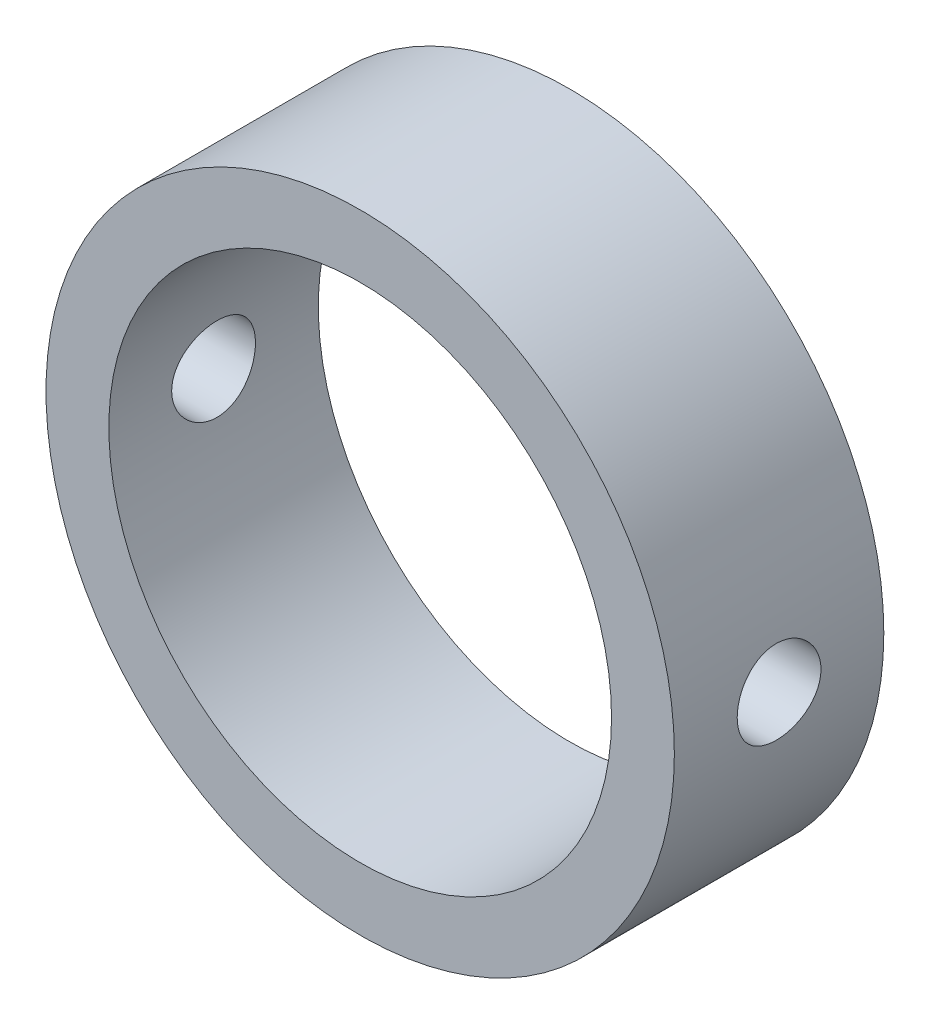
ISO-10303-21;
HEADER;
FILE_DESCRIPTION(('STEP AP214'),'2;1');
FILE_NAME('part.step','',(''),(''),'','','');
FILE_SCHEMA(('AUTOMOTIVE_DESIGN { 1 0 10303 214 1 1 1 1 }'));
ENDSEC;
DATA;
#1=APPLICATION_CONTEXT('core data for automotive mechanical design processes');
#2=APPLICATION_PROTOCOL_DEFINITION('international standard','automotive_design',2000,#1);
#3=PRODUCT_CONTEXT('',#1,'mechanical');
#4=PRODUCT('Part','Part','',(#3));
#5=PRODUCT_RELATED_PRODUCT_CATEGORY('part','',(#4));
#6=PRODUCT_DEFINITION_FORMATION('','',#4);
#7=PRODUCT_DEFINITION_CONTEXT('part definition',#1,'design');
#8=PRODUCT_DEFINITION('design','',#6,#7);
#9=PRODUCT_DEFINITION_SHAPE('','',#8);
#10=(LENGTH_UNIT() NAMED_UNIT(*) SI_UNIT(.MILLI.,.METRE.));
#11=(NAMED_UNIT(*) PLANE_ANGLE_UNIT() SI_UNIT($,.RADIAN.));
#12=(NAMED_UNIT(*) SI_UNIT($,.STERADIAN.) SOLID_ANGLE_UNIT());
#13=UNCERTAINTY_MEASURE_WITH_UNIT(LENGTH_MEASURE(1.E-05),#10,'distance_accuracy_value','');
#14=(GEOMETRIC_REPRESENTATION_CONTEXT(3) GLOBAL_UNCERTAINTY_ASSIGNED_CONTEXT((#13)) GLOBAL_UNIT_ASSIGNED_CONTEXT((#10,
#11,#12)) REPRESENTATION_CONTEXT('',''));
#15=CARTESIAN_POINT('',(0.,0.,0.));
#16=DIRECTION('',(0.,0.,1.));
#17=DIRECTION('',(1.,0.,0.));
#18=AXIS2_PLACEMENT_3D('',#15,#16,#17);
#19=CARTESIAN_POINT('',(0.,0.,20.));
#20=DIRECTION('',(0.,0.,1.));
#21=DIRECTION('',(1.,0.,0.));
#22=AXIS2_PLACEMENT_3D('',#19,#20,#21);
#23=PLANE('',#22);
#24=CARTESIAN_POINT('',(0.,0.,20.));
#25=DIRECTION('',(0.,0.,1.));
#26=DIRECTION('',(1.,0.,0.));
#27=AXIS2_PLACEMENT_3D('',#24,#25,#26);
#28=CIRCLE('',#27,30.);
#29=CARTESIAN_POINT('',(30.,0.,20.));
#30=VERTEX_POINT('',#29);
#31=EDGE_CURVE('E10',#30,#30,#28,.T.);
#32=ORIENTED_EDGE('',*,*,#31,.T.);
#33=EDGE_LOOP('',(#32));
#34=FACE_BOUND('',#33,.T.);
#35=CARTESIAN_POINT('',(0.,0.,20.));
#36=DIRECTION('',(0.,0.,1.));
#37=DIRECTION('',(1.,0.,0.));
#38=AXIS2_PLACEMENT_3D('',#35,#36,#37);
#39=CIRCLE('',#38,24.);
#40=CARTESIAN_POINT('',(24.,0.,20.));
#41=VERTEX_POINT('',#40);
#42=EDGE_CURVE('E47',#41,#41,#39,.T.);
#43=ORIENTED_EDGE('',*,*,#42,.F.);
#44=EDGE_LOOP('',(#43));
#45=FACE_BOUND('',#44,.T.);
#46=ADVANCED_FACE('F29',(#34,#45),#23,.T.);
#47=CARTESIAN_POINT('',(0.,0.,0.));
#48=DIRECTION('',(0.,0.,1.));
#49=DIRECTION('',(1.,0.,0.));
#50=AXIS2_PLACEMENT_3D('',#47,#48,#49);
#51=PLANE('',#50);
#52=CARTESIAN_POINT('',(0.,0.,0.));
#53=DIRECTION('',(0.,0.,1.));
#54=DIRECTION('',(1.,0.,0.));
#55=AXIS2_PLACEMENT_3D('',#52,#53,#54);
#56=CIRCLE('',#55,30.);
#57=CARTESIAN_POINT('',(30.,0.,0.));
#58=VERTEX_POINT('',#57);
#59=EDGE_CURVE('E42',#58,#58,#56,.T.);
#60=ORIENTED_EDGE('',*,*,#59,.F.);
#61=EDGE_LOOP('',(#60));
#62=FACE_BOUND('',#61,.T.);
#63=CARTESIAN_POINT('',(0.,0.,0.));
#64=DIRECTION('',(0.,0.,1.));
#65=DIRECTION('',(1.,0.,0.));
#66=AXIS2_PLACEMENT_3D('',#63,#64,#65);
#67=CIRCLE('',#66,24.);
#68=CARTESIAN_POINT('',(24.,0.,0.));
#69=VERTEX_POINT('',#68);
#70=EDGE_CURVE('E76',#69,#69,#67,.T.);
#71=ORIENTED_EDGE('',*,*,#70,.T.);
#72=EDGE_LOOP('',(#71));
#73=FACE_BOUND('',#72,.T.);
#74=ADVANCED_FACE('F84',(#62,#73),#51,.F.);
#75=CARTESIAN_POINT('',(0.,0.,20.));
#76=DIRECTION('',(0.,0.,-1.));
#77=DIRECTION('',(-1.,0.,0.));
#78=AXIS2_PLACEMENT_3D('',#75,#76,#77);
#79=CYLINDRICAL_SURFACE('',#78,30.);
#80=CARTESIAN_POINT('',(-30.,0.,14.));
#81=CARTESIAN_POINT('',(-29.9999967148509,-0.223617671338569,13.9999905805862));
#82=CARTESIAN_POINT('',(-29.9974734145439,-0.44737195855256,13.9811849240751));
#83=CARTESIAN_POINT('',(-29.9876502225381,-0.888645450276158,13.9064673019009));
#84=CARTESIAN_POINT('',(-29.9803454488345,-1.10615804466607,13.8505174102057));
#85=CARTESIAN_POINT('',(-29.9617815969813,-1.52849662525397,13.7031965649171));
#86=CARTESIAN_POINT('',(-29.9505252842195,-1.73333136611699,13.6118503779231));
#87=CARTESIAN_POINT('',(-29.9253077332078,-2.1247277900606,13.3963861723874));
#88=CARTESIAN_POINT('',(-29.9113469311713,-2.31129241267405,13.2722734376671));
#89=CARTESIAN_POINT('',(-29.8821798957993,-2.66205164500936,12.9939734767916));
#90=CARTESIAN_POINT('',(-29.8669671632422,-2.82611597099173,12.8396227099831));
#91=CARTESIAN_POINT('',(-29.837062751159,-3.12609471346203,12.5055796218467));
#92=CARTESIAN_POINT('',(-29.8223710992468,-3.26200763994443,12.3258859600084));
#93=CARTESIAN_POINT('',(-29.7951087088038,-3.50231804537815,11.9454017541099));
#94=CARTESIAN_POINT('',(-29.7825463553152,-3.60659214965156,11.7445326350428));
#95=CARTESIAN_POINT('',(-29.7610517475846,-3.7798769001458,11.3279378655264));
#96=CARTESIAN_POINT('',(-29.7521193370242,-3.84888906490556,11.1122128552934));
#97=CARTESIAN_POINT('',(-29.7389587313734,-3.94929213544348,10.6733883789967));
#98=CARTESIAN_POINT('',(-29.7347029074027,-3.98090408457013,10.4503403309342));
#99=CARTESIAN_POINT('',(-29.7312930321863,-4.00629361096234,10.0020676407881));
#100=CARTESIAN_POINT('',(-29.732138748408,-4.00007291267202,9.77684309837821));
#101=CARTESIAN_POINT('',(-29.7388111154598,-3.95015491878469,9.33215773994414));
#102=CARTESIAN_POINT('',(-29.7446052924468,-3.90670195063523,9.11266894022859));
#103=CARTESIAN_POINT('',(-29.7604710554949,-3.78393449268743,8.68412632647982));
#104=CARTESIAN_POINT('',(-29.7705427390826,-3.70461918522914,8.47507275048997));
#105=CARTESIAN_POINT('',(-29.7938652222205,-3.51211858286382,8.0725807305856));
#106=CARTESIAN_POINT('',(-29.807125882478,-3.39882795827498,7.87919325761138));
#107=CARTESIAN_POINT('',(-29.8353247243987,-3.14166786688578,7.51408183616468));
#108=CARTESIAN_POINT('',(-29.8502629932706,-2.9977968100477,7.34235901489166));
#109=CARTESIAN_POINT('',(-29.8802779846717,-2.68220980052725,7.02403397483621));
#110=CARTESIAN_POINT('',(-29.8953548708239,-2.51028341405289,6.87764031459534));
#111=CARTESIAN_POINT('',(-29.9238384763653,-2.14418834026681,6.61575591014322));
#112=CARTESIAN_POINT('',(-29.9372451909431,-1.95001958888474,6.50026525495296));
#113=CARTESIAN_POINT('',(-29.9608878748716,-1.54478443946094,6.30346176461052));
#114=CARTESIAN_POINT('',(-29.9711225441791,-1.33371115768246,6.22216293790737));
#115=CARTESIAN_POINT('',(-29.9872565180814,-0.900741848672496,6.09622136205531));
#116=CARTESIAN_POINT('',(-29.9931560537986,-0.678846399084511,6.05157665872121));
#117=CARTESIAN_POINT('',(-29.9999248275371,-0.232333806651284,6.00048313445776));
#118=CARTESIAN_POINT('',(-30.0008318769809,-0.00775006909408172,5.99374719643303));
#119=CARTESIAN_POINT('',(-29.9976158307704,0.439343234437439,6.01790332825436));
#120=CARTESIAN_POINT('',(-29.993492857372,0.661852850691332,6.04879448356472));
#121=CARTESIAN_POINT('',(-29.980703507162,1.09762743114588,6.14708930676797));
#122=CARTESIAN_POINT('',(-29.9720542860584,1.31092403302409,6.2143551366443));
#123=CARTESIAN_POINT('',(-29.9511801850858,1.72321019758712,6.38334593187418));
#124=CARTESIAN_POINT('',(-29.9389551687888,1.92219921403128,6.4850722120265));
#125=CARTESIAN_POINT('',(-29.9121967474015,2.30149775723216,6.72078431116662));
#126=CARTESIAN_POINT('',(-29.8976503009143,2.48169162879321,6.85495473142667));
#127=CARTESIAN_POINT('',(-29.8679145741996,2.8171058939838,7.15148665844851));
#128=CARTESIAN_POINT('',(-29.8527252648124,2.97232515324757,7.31384944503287));
#129=CARTESIAN_POINT('',(-29.8232980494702,3.25441098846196,7.6634262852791));
#130=CARTESIAN_POINT('',(-29.809066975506,3.38108655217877,7.85079513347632));
#131=CARTESIAN_POINT('',(-29.7832826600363,3.60116702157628,8.24431882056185));
#132=CARTESIAN_POINT('',(-29.7717293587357,3.69457267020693,8.45047323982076));
#133=CARTESIAN_POINT('',(-29.7526562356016,3.84515673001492,8.87511448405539));
#134=CARTESIAN_POINT('',(-29.745124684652,3.90244057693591,9.09356337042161));
#135=CARTESIAN_POINT('',(-29.7349149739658,3.97949334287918,9.53708726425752));
#136=CARTESIAN_POINT('',(-29.7322365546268,3.99926426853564,9.76216191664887));
#137=CARTESIAN_POINT('',(-29.732044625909,4.00068971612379,10.210646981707));
#138=CARTESIAN_POINT('',(-29.7344904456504,3.98264438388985,10.4340564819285));
#139=CARTESIAN_POINT('',(-29.744183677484,3.90958753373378,10.8746357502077));
#140=CARTESIAN_POINT('',(-29.7514310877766,3.85457602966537,11.091805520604));
#141=CARTESIAN_POINT('',(-29.7698978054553,3.70924620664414,11.5136873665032));
#142=CARTESIAN_POINT('',(-29.781115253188,3.61894441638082,11.7184052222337));
#143=CARTESIAN_POINT('',(-29.8062609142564,3.40562685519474,12.1098317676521));
#144=CARTESIAN_POINT('',(-29.8201891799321,3.28261045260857,12.2965401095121));
#145=CARTESIAN_POINT('',(-29.8493193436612,3.00624897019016,12.6481792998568));
#146=CARTESIAN_POINT('',(-29.8645301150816,2.85268054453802,12.8129338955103));
#147=CARTESIAN_POINT('',(-29.8944343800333,2.52004338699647,13.1144464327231));
#148=CARTESIAN_POINT('',(-29.9091277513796,2.34096868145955,13.2511977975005));
#149=CARTESIAN_POINT('',(-29.9364127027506,1.96150597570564,13.493334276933));
#150=CARTESIAN_POINT('',(-29.9489949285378,1.76102924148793,13.5985813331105));
#151=CARTESIAN_POINT('',(-29.9705464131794,1.34518481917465,13.7737611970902));
#152=CARTESIAN_POINT('',(-29.9795195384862,1.12983335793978,13.8437318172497));
#153=CARTESIAN_POINT('',(-29.9907144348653,0.761176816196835,13.9298960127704));
#154=CARTESIAN_POINT('',(-29.9941792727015,0.610182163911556,13.9561464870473));
#155=CARTESIAN_POINT('',(-29.9988231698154,0.306146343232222,13.9912016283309));
#156=CARTESIAN_POINT('',(-30.000002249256,0.15310519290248,14.0000064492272));
#157=CARTESIAN_POINT('',(-30.,0.,14.));
#158=B_SPLINE_CURVE_WITH_KNOTS('',3,(#80,#81,#82,#83,#84,#85,#86,#87,#88,#89,#90,#91,#92,#93,
#94,#95,#96,#97,#98,#99,#100,#101,#102,#103,#104,#105,#106,#107,#108,#109,#110,#111,#112,#113,
#114,#115,#116,#117,#118,#119,#120,#121,#122,#123,#124,#125,#126,#127,#128,#129,#130,#131,#132,
#133,#134,#135,#136,#137,#138,#139,#140,#141,#142,#143,#144,#145,#146,#147,#148,#149,#150,#151,
#152,#153,#154,#155,#156,#157),.UNSPECIFIED.,.T.,.F.,(4,2,2,2,2,2,2,2,2,2,2,2,2,2,2,2,2,2,2,2,2,
2,2,2,2,2,2,2,2,2,2,2,2,2,2,2,2,2,4),(0.,0.670293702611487,1.34127286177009,2.01178338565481,
2.68218585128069,3.35631956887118,4.03048895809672,4.70725443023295,5.38399075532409,
6.05670711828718,6.7293928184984,7.39769770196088,8.06601782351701,8.73643166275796,
9.40688036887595,10.082610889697,10.7583433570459,11.4343524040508,12.1103254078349,
12.7811716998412,13.4520016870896,14.1203072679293,14.7886383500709,15.4608654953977,
16.1331231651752,16.809754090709,17.486369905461,18.1610014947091,18.8355969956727,
19.5048585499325,20.1741198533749,20.8430680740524,21.5120292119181,22.1860733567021,
22.8602756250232,23.5373905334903,24.2137780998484,24.6727147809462,25.1316474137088),.UNSPECIFIED.);
#159=CARTESIAN_POINT('',(-30.,0.,14.));
#160=VERTEX_POINT('',#159);
#161=EDGE_CURVE('E71',#160,#160,#158,.T.);
#162=ORIENTED_EDGE('',*,*,#161,.T.);
#163=EDGE_LOOP('',(#162));
#164=FACE_BOUND('',#163,.T.);
#165=CARTESIAN_POINT('',(30.,0.,6.));
#166=CARTESIAN_POINT('',(29.9999967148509,-0.223617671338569,6.00000941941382));
#167=CARTESIAN_POINT('',(29.9974734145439,-0.44737195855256,6.01881507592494));
#168=CARTESIAN_POINT('',(29.9876502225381,-0.888645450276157,6.09353269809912));
#169=CARTESIAN_POINT('',(29.9803454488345,-1.10615804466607,6.1494825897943));
#170=CARTESIAN_POINT('',(29.9617815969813,-1.52849662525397,6.2968034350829));
#171=CARTESIAN_POINT('',(29.9505252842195,-1.73333136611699,6.38814962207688));
#172=CARTESIAN_POINT('',(29.9253077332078,-2.1247277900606,6.60361382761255));
#173=CARTESIAN_POINT('',(29.9113469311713,-2.31129241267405,6.72772656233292));
#174=CARTESIAN_POINT('',(29.8821798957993,-2.66205164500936,7.00602652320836));
#175=CARTESIAN_POINT('',(29.8669671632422,-2.82611597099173,7.16037729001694));
#176=CARTESIAN_POINT('',(29.837062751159,-3.12609471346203,7.49442037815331));
#177=CARTESIAN_POINT('',(29.8223710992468,-3.26200763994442,7.67411403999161));
#178=CARTESIAN_POINT('',(29.7951087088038,-3.50231804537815,8.05459824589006));
#179=CARTESIAN_POINT('',(29.7825463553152,-3.60659214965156,8.25546736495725));
#180=CARTESIAN_POINT('',(29.7610517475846,-3.7798769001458,8.67206213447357));
#181=CARTESIAN_POINT('',(29.7521193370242,-3.84888906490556,8.88778714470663));
#182=CARTESIAN_POINT('',(29.7389587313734,-3.94929213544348,9.32661162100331));
#183=CARTESIAN_POINT('',(29.7347029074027,-3.98090408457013,9.54965966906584));
#184=CARTESIAN_POINT('',(29.7312930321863,-4.00629361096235,9.99793235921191));
#185=CARTESIAN_POINT('',(29.732138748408,-4.00007291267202,10.2231569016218));
#186=CARTESIAN_POINT('',(29.7388111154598,-3.95015491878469,10.6678422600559));
#187=CARTESIAN_POINT('',(29.7446052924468,-3.90670195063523,10.8873310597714));
#188=CARTESIAN_POINT('',(29.7604710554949,-3.78393449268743,11.3158736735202));
#189=CARTESIAN_POINT('',(29.7705427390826,-3.70461918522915,11.52492724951));
#190=CARTESIAN_POINT('',(29.7938652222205,-3.51211858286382,11.9274192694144));
#191=CARTESIAN_POINT('',(29.807125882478,-3.39882795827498,12.1208067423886));
#192=CARTESIAN_POINT('',(29.8353247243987,-3.14166786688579,12.4859181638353));
#193=CARTESIAN_POINT('',(29.8502629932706,-2.9977968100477,12.6576409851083));
#194=CARTESIAN_POINT('',(29.8802779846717,-2.68220980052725,12.9759660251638));
#195=CARTESIAN_POINT('',(29.8953548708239,-2.51028341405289,13.1223596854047));
#196=CARTESIAN_POINT('',(29.9238384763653,-2.14418834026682,13.3842440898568));
#197=CARTESIAN_POINT('',(29.9372451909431,-1.95001958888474,13.499734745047));
#198=CARTESIAN_POINT('',(29.9608878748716,-1.54478443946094,13.6965382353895));
#199=CARTESIAN_POINT('',(29.9711225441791,-1.33371115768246,13.7778370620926));
#200=CARTESIAN_POINT('',(29.9872565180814,-0.900741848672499,13.9037786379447));
#201=CARTESIAN_POINT('',(29.9931560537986,-0.678846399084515,13.9484233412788));
#202=CARTESIAN_POINT('',(29.9999248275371,-0.232333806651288,13.9995168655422));
#203=CARTESIAN_POINT('',(30.0008318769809,-0.00775006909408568,14.006252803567));
#204=CARTESIAN_POINT('',(29.9976158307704,0.439343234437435,13.9820966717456));
#205=CARTESIAN_POINT('',(29.993492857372,0.661852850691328,13.9512055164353));
#206=CARTESIAN_POINT('',(29.980703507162,1.09762743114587,13.852910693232));
#207=CARTESIAN_POINT('',(29.9720542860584,1.31092403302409,13.7856448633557));
#208=CARTESIAN_POINT('',(29.9511801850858,1.72321019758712,13.6166540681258));
#209=CARTESIAN_POINT('',(29.9389551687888,1.92219921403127,13.5149277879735));
#210=CARTESIAN_POINT('',(29.9121967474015,2.30149775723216,13.2792156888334));
#211=CARTESIAN_POINT('',(29.8976503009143,2.48169162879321,13.1450452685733));
#212=CARTESIAN_POINT('',(29.8679145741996,2.81710589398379,12.8485133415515));
#213=CARTESIAN_POINT('',(29.8527252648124,2.97232515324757,12.6861505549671));
#214=CARTESIAN_POINT('',(29.8232980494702,3.25441098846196,12.3365737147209));
#215=CARTESIAN_POINT('',(29.809066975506,3.38108655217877,12.1492048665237));
#216=CARTESIAN_POINT('',(29.7832826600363,3.60116702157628,11.7556811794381));
#217=CARTESIAN_POINT('',(29.7717293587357,3.69457267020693,11.5495267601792));
#218=CARTESIAN_POINT('',(29.7526562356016,3.84515673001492,11.1248855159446));
#219=CARTESIAN_POINT('',(29.745124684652,3.90244057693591,10.9064366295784));
#220=CARTESIAN_POINT('',(29.7349149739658,3.97949334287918,10.4629127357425));
#221=CARTESIAN_POINT('',(29.7322365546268,3.99926426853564,10.2378380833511));
#222=CARTESIAN_POINT('',(29.732044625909,4.00068971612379,9.78935301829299));
#223=CARTESIAN_POINT('',(29.7344904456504,3.98264438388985,9.56594351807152));
#224=CARTESIAN_POINT('',(29.744183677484,3.90958753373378,9.12536424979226));
#225=CARTESIAN_POINT('',(29.7514310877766,3.85457602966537,8.90819447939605));
#226=CARTESIAN_POINT('',(29.7698978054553,3.70924620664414,8.48631263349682));
#227=CARTESIAN_POINT('',(29.781115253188,3.61894441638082,8.28159477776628));
#228=CARTESIAN_POINT('',(29.8062609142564,3.40562685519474,7.89016823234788));
#229=CARTESIAN_POINT('',(29.8201891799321,3.28261045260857,7.70345989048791));
#230=CARTESIAN_POINT('',(29.8493193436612,3.00624897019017,7.35182070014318));
#231=CARTESIAN_POINT('',(29.8645301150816,2.85268054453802,7.18706610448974));
#232=CARTESIAN_POINT('',(29.8944343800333,2.52004338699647,6.88555356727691));
#233=CARTESIAN_POINT('',(29.9091277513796,2.34096868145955,6.7488022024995));
#234=CARTESIAN_POINT('',(29.9364127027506,1.96150597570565,6.50666572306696));
#235=CARTESIAN_POINT('',(29.9489949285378,1.76102924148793,6.40141866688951));
#236=CARTESIAN_POINT('',(29.9705464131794,1.34518481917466,6.22623880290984));
#237=CARTESIAN_POINT('',(29.9795195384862,1.12983335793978,6.15626818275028));
#238=CARTESIAN_POINT('',(29.9907144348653,0.761176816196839,6.07010398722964));
#239=CARTESIAN_POINT('',(29.9941792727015,0.610182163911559,6.04385351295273));
#240=CARTESIAN_POINT('',(29.9988231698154,0.306146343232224,6.00879837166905));
#241=CARTESIAN_POINT('',(30.000002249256,0.153105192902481,5.99999355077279));
#242=CARTESIAN_POINT('',(30.,0.,6.));
#243=B_SPLINE_CURVE_WITH_KNOTS('',3,(#165,#166,#167,#168,#169,#170,#171,#172,#173,#174,#175,
#176,#177,#178,#179,#180,#181,#182,#183,#184,#185,#186,#187,#188,#189,#190,#191,#192,#193,#194,
#195,#196,#197,#198,#199,#200,#201,#202,#203,#204,#205,#206,#207,#208,#209,#210,#211,#212,#213,
#214,#215,#216,#217,#218,#219,#220,#221,#222,#223,#224,#225,#226,#227,#228,#229,#230,#231,#232,
#233,#234,#235,#236,#237,#238,#239,#240,#241,#242),.UNSPECIFIED.,.T.,.F.,(4,2,2,2,2,2,2,2,2,2,2,
2,2,2,2,2,2,2,2,2,2,2,2,2,2,2,2,2,2,2,2,2,2,2,2,2,2,2,4),(0.,0.670293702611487,1.34127286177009,
2.01178338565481,2.68218585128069,3.35631956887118,4.03048895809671,4.70725443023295,
5.38399075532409,6.05670711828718,6.7293928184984,7.39769770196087,8.06601782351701,
8.73643166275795,9.40688036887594,10.082610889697,10.7583433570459,11.4343524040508,
12.1103254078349,12.7811716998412,13.4520016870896,14.1203072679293,14.7886383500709,
15.4608654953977,16.1331231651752,16.809754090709,17.486369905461,18.1610014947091,
18.8355969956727,19.5048585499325,20.1741198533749,20.8430680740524,21.5120292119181,
22.1860733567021,22.8602756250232,23.5373905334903,24.2137780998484,24.6727147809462,
25.1316474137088),.UNSPECIFIED.);
#244=CARTESIAN_POINT('',(30.,0.,6.));
#245=VERTEX_POINT('',#244);
#246=EDGE_CURVE('E67',#245,#245,#243,.T.);
#247=ORIENTED_EDGE('',*,*,#246,.T.);
#248=EDGE_LOOP('',(#247));
#249=FACE_BOUND('',#248,.T.);
#250=ORIENTED_EDGE('',*,*,#31,.F.);
#251=EDGE_LOOP('',(#250));
#252=FACE_BOUND('',#251,.T.);
#253=ORIENTED_EDGE('',*,*,#59,.T.);
#254=EDGE_LOOP('',(#253));
#255=FACE_BOUND('',#254,.T.);
#256=ADVANCED_FACE('F31',(#164,#249,#252,#255),#79,.T.);
#257=CARTESIAN_POINT('',(0.,0.,20.));
#258=DIRECTION('',(0.,0.,-1.));
#259=DIRECTION('',(-1.,0.,0.));
#260=AXIS2_PLACEMENT_3D('',#257,#258,#259);
#261=CYLINDRICAL_SURFACE('',#260,24.);
#262=CARTESIAN_POINT('',(-24.,0.,14.));
#263=CARTESIAN_POINT('',(-23.9999961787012,-0.223025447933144,13.9999910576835));
#264=CARTESIAN_POINT('',(-23.9968588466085,-0.446172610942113,13.9812843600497));
#265=CARTESIAN_POINT('',(-23.9846455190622,-0.886208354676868,13.9069829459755));
#266=CARTESIAN_POINT('',(-23.9755640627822,-1.1030909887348,13.8513543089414));
#267=CARTESIAN_POINT('',(-23.9524810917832,-1.52416759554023,13.7049352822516));
#268=CARTESIAN_POINT('',(-23.9384836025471,-1.72837178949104,13.6141736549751));
#269=CARTESIAN_POINT('',(-23.9071076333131,-2.11862694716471,13.4001403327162));
#270=CARTESIAN_POINT('',(-23.8897295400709,-2.30467998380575,13.2768723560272));
#271=CARTESIAN_POINT('',(-23.853333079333,-2.65515618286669,13.0000718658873));
#272=CARTESIAN_POINT('',(-23.8343019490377,-2.81938064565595,12.8462894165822));
#273=CARTESIAN_POINT('',(-23.7968420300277,-3.11982159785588,12.5133632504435));
#274=CARTESIAN_POINT('',(-23.7784132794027,-3.25603631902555,12.3342179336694));
#275=CARTESIAN_POINT('',(-23.7441210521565,-3.49738740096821,11.9542864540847));
#276=CARTESIAN_POINT('',(-23.7282740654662,-3.6023272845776,11.7533738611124));
#277=CARTESIAN_POINT('',(-23.7011166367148,-3.77689338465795,11.336464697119));
#278=CARTESIAN_POINT('',(-23.6898058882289,-3.84652198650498,11.1204691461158));
#279=CARTESIAN_POINT('',(-23.6731285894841,-3.94786300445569,10.6816315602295));
#280=CARTESIAN_POINT('',(-23.6677082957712,-3.97991844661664,10.4588708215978));
#281=CARTESIAN_POINT('',(-23.6632630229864,-4.0062667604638,10.0110715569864));
#282=CARTESIAN_POINT('',(-23.6642375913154,-4.0005623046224,9.78603319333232));
#283=CARTESIAN_POINT('',(-23.6724228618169,-3.95183215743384,9.34251542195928));
#284=CARTESIAN_POINT('',(-23.6795691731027,-3.90919181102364,9.12399231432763));
#285=CARTESIAN_POINT('',(-23.6991919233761,-3.78840502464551,8.69724589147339));
#286=CARTESIAN_POINT('',(-23.7116685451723,-3.71025736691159,8.48902292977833));
#287=CARTESIAN_POINT('',(-23.7406156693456,-3.52028359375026,8.08763388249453));
#288=CARTESIAN_POINT('',(-23.7571050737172,-3.40829746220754,7.89454495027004));
#289=CARTESIAN_POINT('',(-23.7922066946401,-3.15393922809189,7.52975295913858));
#290=CARTESIAN_POINT('',(-23.8108190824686,-3.01156467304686,7.35805162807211));
#291=CARTESIAN_POINT('',(-23.8483524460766,-2.69837153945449,7.03867826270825));
#292=CARTESIAN_POINT('',(-23.8672743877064,-2.527222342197,6.89133037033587));
#293=CARTESIAN_POINT('',(-23.9030816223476,-2.16245639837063,6.62739557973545));
#294=CARTESIAN_POINT('',(-23.9199669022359,-1.96883950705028,6.51080887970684));
#295=CARTESIAN_POINT('',(-23.9498222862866,-1.56432946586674,6.31167643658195));
#296=CARTESIAN_POINT('',(-23.9627890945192,-1.35342196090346,6.22915932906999));
#297=CARTESIAN_POINT('',(-23.9833200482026,-0.92047735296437,6.10080925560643));
#298=CARTESIAN_POINT('',(-23.9908846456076,-0.698441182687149,6.05497322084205));
#299=CARTESIAN_POINT('',(-23.999698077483,-0.252335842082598,6.00172582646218));
#300=CARTESIAN_POINT('',(-24.0010200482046,-0.0283211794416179,5.99386948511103));
#301=CARTESIAN_POINT('',(-23.9973995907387,0.41782363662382,6.015618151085));
#302=CARTESIAN_POINT('',(-23.9924574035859,0.639953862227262,6.04522171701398));
#303=CARTESIAN_POINT('',(-23.9769092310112,1.07464988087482,6.14067975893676));
#304=CARTESIAN_POINT('',(-23.966337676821,1.28726538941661,6.2063139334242));
#305=CARTESIAN_POINT('',(-23.9407114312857,1.69847501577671,6.37173522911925));
#306=CARTESIAN_POINT('',(-23.9256564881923,1.89706834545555,6.47152426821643));
#307=CARTESIAN_POINT('',(-23.8925522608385,2.27652910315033,6.70344179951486));
#308=CARTESIAN_POINT('',(-23.8744776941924,2.45722440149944,6.8358482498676));
#309=CARTESIAN_POINT('',(-23.8374154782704,2.7939897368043,7.12885970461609));
#310=CARTESIAN_POINT('',(-23.8184277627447,2.95005798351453,7.28946675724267));
#311=CARTESIAN_POINT('',(-23.7814428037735,3.2347884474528,7.63631607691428));
#312=CARTESIAN_POINT('',(-23.7634578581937,3.36315001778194,7.82280666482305));
#313=CARTESIAN_POINT('',(-23.7307444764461,3.58672369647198,8.21496475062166));
#314=CARTESIAN_POINT('',(-23.7160159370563,3.68193685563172,8.42063164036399));
#315=CARTESIAN_POINT('',(-23.6915752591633,3.83606133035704,8.84446357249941));
#316=CARTESIAN_POINT('',(-23.681842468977,3.89512229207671,9.06257295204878));
#317=CARTESIAN_POINT('',(-23.6684434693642,3.97573672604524,9.50579220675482));
#318=CARTESIAN_POINT('',(-23.6647767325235,3.99729345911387,9.73090147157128));
#319=CARTESIAN_POINT('',(-23.6639477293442,4.00219658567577,10.1787282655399));
#320=CARTESIAN_POINT('',(-23.6667049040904,3.9860162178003,10.4014406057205));
#321=CARTESIAN_POINT('',(-23.6782365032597,3.91692774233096,10.8409267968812));
#322=CARTESIAN_POINT('',(-23.6870109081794,3.86401975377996,11.057700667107));
#323=CARTESIAN_POINT('',(-23.7095577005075,3.72315918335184,11.4789734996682));
#324=CARTESIAN_POINT('',(-23.7233242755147,3.63524734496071,11.6834864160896));
#325=CARTESIAN_POINT('',(-23.7543099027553,3.42692320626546,12.0749370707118));
#326=CARTESIAN_POINT('',(-23.7715291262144,3.3065092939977,12.2618739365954));
#327=CARTESIAN_POINT('',(-23.80773526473,3.03491021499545,12.6152569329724));
#328=CARTESIAN_POINT('',(-23.8267407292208,2.88337690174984,12.7814336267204));
#329=CARTESIAN_POINT('',(-23.8642299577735,2.55457445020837,13.0861625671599));
#330=CARTESIAN_POINT('',(-23.8827136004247,2.37729938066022,13.2247084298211));
#331=CARTESIAN_POINT('',(-23.9172244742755,2.00059067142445,13.4711172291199));
#332=CARTESIAN_POINT('',(-23.9332338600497,1.80101246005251,13.5787616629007));
#333=CARTESIAN_POINT('',(-23.9608186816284,1.38642091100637,13.7588311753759));
#334=CARTESIAN_POINT('',(-23.9723985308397,1.17142319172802,13.8312913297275));
#335=CARTESIAN_POINT('',(-23.9872926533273,0.796325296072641,13.9232084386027));
#336=CARTESIAN_POINT('',(-23.9920324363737,0.638494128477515,13.9519591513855));
#337=CARTESIAN_POINT('',(-23.9983874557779,0.320462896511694,13.9903579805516));
#338=CARTESIAN_POINT('',(-24.0000027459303,0.160262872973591,14.0000064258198));
#339=CARTESIAN_POINT('',(-24.,0.,14.));
#340=B_SPLINE_CURVE_WITH_KNOTS('',3,(#262,#263,#264,#265,#266,#267,#268,#269,#270,#271,#272,
#273,#274,#275,#276,#277,#278,#279,#280,#281,#282,#283,#284,#285,#286,#287,#288,#289,#290,#291,
#292,#293,#294,#295,#296,#297,#298,#299,#300,#301,#302,#303,#304,#305,#306,#307,#308,#309,#310,
#311,#312,#313,#314,#315,#316,#317,#318,#319,#320,#321,#322,#323,#324,#325,#326,#327,#328,#329,
#330,#331,#332,#333,#334,#335,#336,#337,#338,#339),.UNSPECIFIED.,.T.,.F.,(4,2,2,2,2,2,2,2,2,2,2,
2,2,2,2,2,2,2,2,2,2,2,2,2,2,2,2,2,2,2,2,2,2,2,2,2,2,2,4),(0.,0.668490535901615,1.33759607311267,
2.00615498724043,2.67463746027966,3.34883985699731,4.02308480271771,4.70148033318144,
5.3798300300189,6.05193723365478,6.72399686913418,7.38912834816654,8.0542826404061,
8.72263290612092,9.39103713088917,10.0677243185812,10.7444158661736,11.4216750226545,
12.0988775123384,12.7681261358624,13.4373490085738,14.1025249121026,14.7677381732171,
15.4388292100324,16.1099690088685,16.7880611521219,17.4661317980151,18.1413763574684,
18.8165622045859,19.4833265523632,20.1500887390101,20.8160770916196,21.4820984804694,
22.1560221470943,22.8301013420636,23.5088357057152,24.1868920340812,24.6672679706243,
25.1476356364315),.UNSPECIFIED.);
#341=CARTESIAN_POINT('',(-24.,0.,14.));
#342=VERTEX_POINT('',#341);
#343=EDGE_CURVE('E34',#342,#342,#340,.T.);
#344=ORIENTED_EDGE('',*,*,#343,.F.);
#345=EDGE_LOOP('',(#344));
#346=FACE_BOUND('',#345,.T.);
#347=CARTESIAN_POINT('',(24.,0.,6.));
#348=CARTESIAN_POINT('',(23.9999961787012,-0.223025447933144,6.00000894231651));
#349=CARTESIAN_POINT('',(23.9968588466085,-0.446172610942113,6.01871563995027));
#350=CARTESIAN_POINT('',(23.9846455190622,-0.886208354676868,6.09301705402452));
#351=CARTESIAN_POINT('',(23.9755640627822,-1.1030909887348,6.14864569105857));
#352=CARTESIAN_POINT('',(23.9524810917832,-1.52416759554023,6.29506471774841));
#353=CARTESIAN_POINT('',(23.9384836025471,-1.72837178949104,6.38582634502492));
#354=CARTESIAN_POINT('',(23.9071076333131,-2.11862694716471,6.59985966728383));
#355=CARTESIAN_POINT('',(23.8897295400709,-2.30467998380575,6.7231276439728));
#356=CARTESIAN_POINT('',(23.853333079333,-2.65515618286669,6.99992813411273));
#357=CARTESIAN_POINT('',(23.8343019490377,-2.81938064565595,7.15371058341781));
#358=CARTESIAN_POINT('',(23.7968420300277,-3.11982159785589,7.4866367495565));
#359=CARTESIAN_POINT('',(23.7784132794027,-3.25603631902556,7.66578206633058));
#360=CARTESIAN_POINT('',(23.7441210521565,-3.49738740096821,8.04571354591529));
#361=CARTESIAN_POINT('',(23.7282740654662,-3.6023272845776,8.24662613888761));
#362=CARTESIAN_POINT('',(23.7011166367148,-3.77689338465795,8.663535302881));
#363=CARTESIAN_POINT('',(23.6898058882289,-3.84652198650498,8.87953085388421));
#364=CARTESIAN_POINT('',(23.6731285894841,-3.94786300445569,9.31836843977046));
#365=CARTESIAN_POINT('',(23.6677082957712,-3.97991844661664,9.54112917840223));
#366=CARTESIAN_POINT('',(23.6632630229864,-4.0062667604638,9.98892844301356));
#367=CARTESIAN_POINT('',(23.6642375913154,-4.00056230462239,10.2139668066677));
#368=CARTESIAN_POINT('',(23.6724228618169,-3.95183215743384,10.6574845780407));
#369=CARTESIAN_POINT('',(23.6795691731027,-3.90919181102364,10.8760076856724));
#370=CARTESIAN_POINT('',(23.6991919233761,-3.78840502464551,11.3027541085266));
#371=CARTESIAN_POINT('',(23.7116685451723,-3.71025736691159,11.5109770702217));
#372=CARTESIAN_POINT('',(23.7406156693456,-3.52028359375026,11.9123661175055));
#373=CARTESIAN_POINT('',(23.7571050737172,-3.40829746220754,12.10545504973));
#374=CARTESIAN_POINT('',(23.7922066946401,-3.15393922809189,12.4702470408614));
#375=CARTESIAN_POINT('',(23.8108190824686,-3.01156467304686,12.6419483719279));
#376=CARTESIAN_POINT('',(23.8483524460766,-2.69837153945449,12.9613217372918));
#377=CARTESIAN_POINT('',(23.8672743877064,-2.527222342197,13.1086696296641));
#378=CARTESIAN_POINT('',(23.9030816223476,-2.16245639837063,13.3726044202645));
#379=CARTESIAN_POINT('',(23.9199669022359,-1.96883950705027,13.4891911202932));
#380=CARTESIAN_POINT('',(23.9498222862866,-1.56432946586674,13.6883235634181));
#381=CARTESIAN_POINT('',(23.9627890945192,-1.35342196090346,13.77084067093));
#382=CARTESIAN_POINT('',(23.9833200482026,-0.920477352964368,13.8991907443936));
#383=CARTESIAN_POINT('',(23.9908846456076,-0.698441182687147,13.9450267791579));
#384=CARTESIAN_POINT('',(23.999698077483,-0.252335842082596,13.9982741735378));
#385=CARTESIAN_POINT('',(24.0010200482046,-0.0283211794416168,14.006130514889));
#386=CARTESIAN_POINT('',(23.9973995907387,0.417823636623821,13.984381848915));
#387=CARTESIAN_POINT('',(23.9924574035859,0.639953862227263,13.954778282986));
#388=CARTESIAN_POINT('',(23.9769092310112,1.07464988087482,13.8593202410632));
#389=CARTESIAN_POINT('',(23.966337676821,1.28726538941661,13.7936860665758));
#390=CARTESIAN_POINT('',(23.9407114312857,1.69847501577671,13.6282647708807));
#391=CARTESIAN_POINT('',(23.9256564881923,1.89706834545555,13.5284757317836));
#392=CARTESIAN_POINT('',(23.8925522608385,2.27652910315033,13.2965582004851));
#393=CARTESIAN_POINT('',(23.8744776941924,2.45722440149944,13.1641517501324));
#394=CARTESIAN_POINT('',(23.8374154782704,2.7939897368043,12.8711402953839));
#395=CARTESIAN_POINT('',(23.8184277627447,2.95005798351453,12.7105332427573));
#396=CARTESIAN_POINT('',(23.7814428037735,3.2347884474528,12.3636839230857));
#397=CARTESIAN_POINT('',(23.7634578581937,3.36315001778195,12.1771933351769));
#398=CARTESIAN_POINT('',(23.7307444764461,3.58672369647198,11.7850352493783));
#399=CARTESIAN_POINT('',(23.7160159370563,3.68193685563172,11.579368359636));
#400=CARTESIAN_POINT('',(23.6915752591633,3.83606133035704,11.1555364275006));
#401=CARTESIAN_POINT('',(23.681842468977,3.89512229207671,10.9374270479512));
#402=CARTESIAN_POINT('',(23.6684434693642,3.97573672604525,10.4942077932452));
#403=CARTESIAN_POINT('',(23.6647767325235,3.99729345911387,10.2690985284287));
#404=CARTESIAN_POINT('',(23.6639477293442,4.00219658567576,9.82127173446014));
#405=CARTESIAN_POINT('',(23.6667049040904,3.9860162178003,9.59855939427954));
#406=CARTESIAN_POINT('',(23.6782365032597,3.91692774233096,9.15907320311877));
#407=CARTESIAN_POINT('',(23.6870109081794,3.86401975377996,8.942299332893));
#408=CARTESIAN_POINT('',(23.7095577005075,3.72315918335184,8.52102650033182));
#409=CARTESIAN_POINT('',(23.7233242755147,3.63524734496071,8.31651358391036));
#410=CARTESIAN_POINT('',(23.7543099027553,3.42692320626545,7.92506292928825));
#411=CARTESIAN_POINT('',(23.7715291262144,3.3065092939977,7.73812606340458));
#412=CARTESIAN_POINT('',(23.8077352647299,3.03491021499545,7.38474306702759));
#413=CARTESIAN_POINT('',(23.8267407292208,2.88337690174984,7.21856637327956));
#414=CARTESIAN_POINT('',(23.8642299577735,2.55457445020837,6.9138374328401));
#415=CARTESIAN_POINT('',(23.8827136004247,2.37729938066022,6.77529157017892));
#416=CARTESIAN_POINT('',(23.9172244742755,2.00059067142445,6.52888277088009));
#417=CARTESIAN_POINT('',(23.9332338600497,1.80101246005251,6.42123833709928));
#418=CARTESIAN_POINT('',(23.9608186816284,1.38642091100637,6.24116882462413));
#419=CARTESIAN_POINT('',(23.9723985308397,1.17142319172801,6.16870867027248));
#420=CARTESIAN_POINT('',(23.9872926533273,0.79632529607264,6.07679156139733));
#421=CARTESIAN_POINT('',(23.9920324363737,0.638494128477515,6.04804084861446));
#422=CARTESIAN_POINT('',(23.9983874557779,0.320462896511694,6.0096420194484));
#423=CARTESIAN_POINT('',(24.0000027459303,0.16026287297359,5.99999357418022));
#424=CARTESIAN_POINT('',(24.,0.,6.));
#425=B_SPLINE_CURVE_WITH_KNOTS('',3,(#347,#348,#349,#350,#351,#352,#353,#354,#355,#356,#357,
#358,#359,#360,#361,#362,#363,#364,#365,#366,#367,#368,#369,#370,#371,#372,#373,#374,#375,#376,
#377,#378,#379,#380,#381,#382,#383,#384,#385,#386,#387,#388,#389,#390,#391,#392,#393,#394,#395,
#396,#397,#398,#399,#400,#401,#402,#403,#404,#405,#406,#407,#408,#409,#410,#411,#412,#413,#414,
#415,#416,#417,#418,#419,#420,#421,#422,#423,#424),.UNSPECIFIED.,.T.,.F.,(4,2,2,2,2,2,2,2,2,2,2,
2,2,2,2,2,2,2,2,2,2,2,2,2,2,2,2,2,2,2,2,2,2,2,2,2,2,2,4),(0.,0.668490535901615,1.33759607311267,
2.00615498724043,2.67463746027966,3.34883985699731,4.02308480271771,4.70148033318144,
5.3798300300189,6.05193723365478,6.72399686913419,7.38912834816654,8.0542826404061,
8.72263290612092,9.39103713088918,10.0677243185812,10.7444158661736,11.4216750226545,
12.0988775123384,12.7681261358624,13.4373490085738,14.1025249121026,14.7677381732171,
15.4388292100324,16.1099690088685,16.7880611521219,17.4661317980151,18.1413763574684,
18.8165622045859,19.4833265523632,20.1500887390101,20.8160770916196,21.4820984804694,
22.1560221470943,22.8301013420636,23.5088357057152,24.1868920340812,24.6672679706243,
25.1476356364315),.UNSPECIFIED.);
#426=CARTESIAN_POINT('',(24.,0.,6.));
#427=VERTEX_POINT('',#426);
#428=EDGE_CURVE('E50',#427,#427,#425,.T.);
#429=ORIENTED_EDGE('',*,*,#428,.F.);
#430=EDGE_LOOP('',(#429));
#431=FACE_BOUND('',#430,.T.);
#432=ORIENTED_EDGE('',*,*,#42,.T.);
#433=EDGE_LOOP('',(#432));
#434=FACE_BOUND('',#433,.T.);
#435=ORIENTED_EDGE('',*,*,#70,.F.);
#436=EDGE_LOOP('',(#435));
#437=FACE_BOUND('',#436,.T.);
#438=ADVANCED_FACE('F54',(#346,#431,#434,#437),#261,.F.);
#439=CARTESIAN_POINT('',(-40.,0.,10.));
#440=DIRECTION('',(1.,0.,0.));
#441=DIRECTION('',(0.,0.,-1.));
#442=AXIS2_PLACEMENT_3D('',#439,#440,#441);
#443=CYLINDRICAL_SURFACE('',#442,4.);
#444=ORIENTED_EDGE('',*,*,#428,.T.);
#445=EDGE_LOOP('',(#444));
#446=FACE_BOUND('',#445,.T.);
#447=ORIENTED_EDGE('',*,*,#246,.F.);
#448=EDGE_LOOP('',(#447));
#449=FACE_BOUND('',#448,.T.);
#450=ADVANCED_FACE('F60',(#446,#449),#443,.F.);
#451=ORIENTED_EDGE('',*,*,#343,.T.);
#452=EDGE_LOOP('',(#451));
#453=FACE_BOUND('',#452,.T.);
#454=ORIENTED_EDGE('',*,*,#161,.F.);
#455=EDGE_LOOP('',(#454));
#456=FACE_BOUND('',#455,.T.);
#457=ADVANCED_FACE('F57',(#453,#456),#443,.F.);
#458=CLOSED_SHELL('',(#46,#74,#256,#438,#450,#457));
#459=MANIFOLD_SOLID_BREP('B2',#458);
#460=ADVANCED_BREP_SHAPE_REPRESENTATION('',(#18,#459),#14);
#461=SHAPE_DEFINITION_REPRESENTATION(#9,#460);
ENDSEC;
END-ISO-10303-21;
